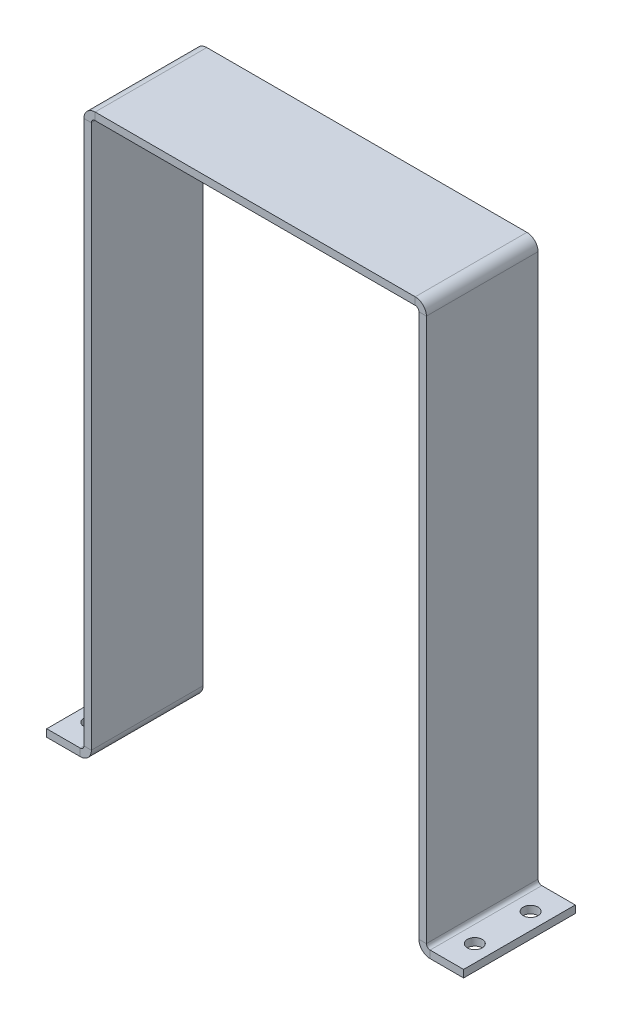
ISO-10303-21;
HEADER;
FILE_DESCRIPTION(('STEP AP214'),'2;1');
FILE_NAME('part.step','',(''),(''),'','','');
FILE_SCHEMA(('AUTOMOTIVE_DESIGN { 1 0 10303 214 1 1 1 1 }'));
ENDSEC;
DATA;
#1=APPLICATION_CONTEXT('core data for automotive mechanical design processes');
#2=APPLICATION_PROTOCOL_DEFINITION('international standard','automotive_design',2000,#1);
#3=PRODUCT_CONTEXT('',#1,'mechanical');
#4=PRODUCT('Part','Part','',(#3));
#5=PRODUCT_RELATED_PRODUCT_CATEGORY('part','',(#4));
#6=PRODUCT_DEFINITION_FORMATION('','',#4);
#7=PRODUCT_DEFINITION_CONTEXT('part definition',#1,'design');
#8=PRODUCT_DEFINITION('design','',#6,#7);
#9=PRODUCT_DEFINITION_SHAPE('','',#8);
#10=(LENGTH_UNIT() NAMED_UNIT(*) SI_UNIT(.MILLI.,.METRE.));
#11=(NAMED_UNIT(*) PLANE_ANGLE_UNIT() SI_UNIT($,.RADIAN.));
#12=(NAMED_UNIT(*) SI_UNIT($,.STERADIAN.) SOLID_ANGLE_UNIT());
#13=UNCERTAINTY_MEASURE_WITH_UNIT(LENGTH_MEASURE(1.E-05),#10,'distance_accuracy_value','');
#14=(GEOMETRIC_REPRESENTATION_CONTEXT(3) GLOBAL_UNCERTAINTY_ASSIGNED_CONTEXT((#13)) GLOBAL_UNIT_ASSIGNED_CONTEXT((#10,
#11,#12)) REPRESENTATION_CONTEXT('',''));
#15=CARTESIAN_POINT('',(0.,0.,0.));
#16=DIRECTION('',(0.,0.,1.));
#17=DIRECTION('',(1.,0.,0.));
#18=AXIS2_PLACEMENT_3D('',#15,#16,#17);
#19=CARTESIAN_POINT('',(-44.,75.5,30.));
#20=DIRECTION('',(0.,0.,1.));
#21=DIRECTION('',(0.,-1.,0.));
#22=AXIS2_PLACEMENT_3D('',#19,#20,#21);
#23=PLANE('',#22);
#24=DIRECTION('',(0.,1.,0.));
#25=VECTOR('',#24,1.);
#26=CARTESIAN_POINT('',(-46.,75.5,30.));
#27=LINE('',#26,#25);
#28=CARTESIAN_POINT('',(-46.,74.5,30.));
#29=VERTEX_POINT('',#28);
#30=CARTESIAN_POINT('',(-46.,-71.5,30.));
#31=VERTEX_POINT('',#30);
#32=EDGE_CURVE('E335',#29,#31,#27,.F.);
#33=ORIENTED_EDGE('',*,*,#32,.T.);
#34=DIRECTION('',(1.,0.,0.));
#35=VECTOR('',#34,1.);
#36=CARTESIAN_POINT('',(-46.,-71.5,30.));
#37=LINE('',#36,#35);
#38=CARTESIAN_POINT('',(-44.,-71.5,30.));
#39=VERTEX_POINT('',#38);
#40=EDGE_CURVE('E259',#31,#39,#37,.T.);
#41=ORIENTED_EDGE('',*,*,#40,.T.);
#42=DIRECTION('',(0.,-1.,0.));
#43=VECTOR('',#42,1.);
#44=CARTESIAN_POINT('',(-44.,75.5,30.));
#45=LINE('',#44,#43);
#46=CARTESIAN_POINT('',(-44.,74.5,30.));
#47=VERTEX_POINT('',#46);
#48=EDGE_CURVE('E380',#47,#39,#45,.T.);
#49=ORIENTED_EDGE('',*,*,#48,.F.);
#50=DIRECTION('',(-1.,0.,0.));
#51=VECTOR('',#50,1.);
#52=CARTESIAN_POINT('',(-44.,74.5,30.));
#53=LINE('',#52,#51);
#54=EDGE_CURVE('E78',#47,#29,#53,.T.);
#55=ORIENTED_EDGE('',*,*,#54,.T.);
#56=EDGE_LOOP('',(#33,#41,#49,#55));
#57=FACE_BOUND('',#56,.T.);
#58=ADVANCED_FACE('F74',(#57),#23,.T.);
#59=CARTESIAN_POINT('',(-46.,75.5,30.));
#60=DIRECTION('',(1.,0.,0.));
#61=DIRECTION('',(0.,1.,0.));
#62=AXIS2_PLACEMENT_3D('',#59,#60,#61);
#63=PLANE('',#62);
#64=DIRECTION('',(0.,0.,1.));
#65=VECTOR('',#64,1.);
#66=CARTESIAN_POINT('',(-46.,-71.5,30.));
#67=LINE('',#66,#65);
#68=CARTESIAN_POINT('',(-46.,-71.5,0.));
#69=VERTEX_POINT('',#68);
#70=EDGE_CURVE('E265',#31,#69,#67,.F.);
#71=ORIENTED_EDGE('',*,*,#70,.F.);
#72=ORIENTED_EDGE('',*,*,#32,.F.);
#73=DIRECTION('',(0.,0.,1.));
#74=VECTOR('',#73,1.);
#75=CARTESIAN_POINT('',(-46.,74.5,30.));
#76=LINE('',#75,#74);
#77=CARTESIAN_POINT('',(-46.,74.5,0.));
#78=VERTEX_POINT('',#77);
#79=EDGE_CURVE('E325',#29,#78,#76,.F.);
#80=ORIENTED_EDGE('',*,*,#79,.T.);
#81=DIRECTION('',(0.,1.,0.));
#82=VECTOR('',#81,1.);
#83=CARTESIAN_POINT('',(-46.,75.5,0.));
#84=LINE('',#83,#82);
#85=EDGE_CURVE('E340',#78,#69,#84,.F.);
#86=ORIENTED_EDGE('',*,*,#85,.T.);
#87=EDGE_LOOP('',(#71,#72,#80,#86));
#88=FACE_BOUND('',#87,.T.);
#89=ADVANCED_FACE('F452',(#88),#63,.F.);
#90=CARTESIAN_POINT('',(-44.,75.5,30.));
#91=DIRECTION('',(1.,0.,0.));
#92=DIRECTION('',(0.,1.,0.));
#93=AXIS2_PLACEMENT_3D('',#90,#91,#92);
#94=PLANE('',#93);
#95=ORIENTED_EDGE('',*,*,#48,.T.);
#96=DIRECTION('',(0.,0.,1.));
#97=VECTOR('',#96,1.);
#98=CARTESIAN_POINT('',(-44.,-71.5,30.));
#99=LINE('',#98,#97);
#100=CARTESIAN_POINT('',(-44.,-71.5,0.));
#101=VERTEX_POINT('',#100);
#102=EDGE_CURVE('E254',#39,#101,#99,.F.);
#103=ORIENTED_EDGE('',*,*,#102,.T.);
#104=DIRECTION('',(0.,-1.,0.));
#105=VECTOR('',#104,1.);
#106=CARTESIAN_POINT('',(-44.,75.5,0.));
#107=LINE('',#106,#105);
#108=CARTESIAN_POINT('',(-44.,74.5,0.));
#109=VERTEX_POINT('',#108);
#110=EDGE_CURVE('E377',#109,#101,#107,.T.);
#111=ORIENTED_EDGE('',*,*,#110,.F.);
#112=DIRECTION('',(0.,0.,-1.));
#113=VECTOR('',#112,1.);
#114=CARTESIAN_POINT('',(-44.,74.5,30.));
#115=LINE('',#114,#113);
#116=EDGE_CURVE('E389',#47,#109,#115,.T.);
#117=ORIENTED_EDGE('',*,*,#116,.F.);
#118=EDGE_LOOP('',(#95,#103,#111,#117));
#119=FACE_BOUND('',#118,.T.);
#120=ADVANCED_FACE('F456',(#119),#94,.T.);
#121=CARTESIAN_POINT('',(44.,75.5,0.));
#122=DIRECTION('',(0.,0.,1.));
#123=DIRECTION('',(0.,1.,0.));
#124=AXIS2_PLACEMENT_3D('',#121,#122,#123);
#125=PLANE('',#124);
#126=DIRECTION('',(0.,-1.,0.));
#127=VECTOR('',#126,1.);
#128=CARTESIAN_POINT('',(46.,75.5,0.));
#129=LINE('',#128,#127);
#130=CARTESIAN_POINT('',(46.,-71.5,0.));
#131=VERTEX_POINT('',#130);
#132=CARTESIAN_POINT('',(46.,74.5,0.));
#133=VERTEX_POINT('',#132);
#134=EDGE_CURVE('E357',#131,#133,#129,.F.);
#135=ORIENTED_EDGE('',*,*,#134,.F.);
#136=DIRECTION('',(-1.,0.,0.));
#137=VECTOR('',#136,1.);
#138=CARTESIAN_POINT('',(46.,-71.5,0.));
#139=LINE('',#138,#137);
#140=CARTESIAN_POINT('',(44.,-71.5,0.));
#141=VERTEX_POINT('',#140);
#142=EDGE_CURVE('E310',#131,#141,#139,.T.);
#143=ORIENTED_EDGE('',*,*,#142,.T.);
#144=DIRECTION('',(0.,1.,0.));
#145=VECTOR('',#144,1.);
#146=CARTESIAN_POINT('',(44.,75.5,0.));
#147=LINE('',#146,#145);
#148=CARTESIAN_POINT('',(44.,74.5,0.));
#149=VERTEX_POINT('',#148);
#150=EDGE_CURVE('E373',#141,#149,#147,.T.);
#151=ORIENTED_EDGE('',*,*,#150,.T.);
#152=DIRECTION('',(1.,0.,0.));
#153=VECTOR('',#152,1.);
#154=CARTESIAN_POINT('',(44.,74.5,0.));
#155=LINE('',#154,#153);
#156=EDGE_CURVE('E410',#149,#133,#155,.T.);
#157=ORIENTED_EDGE('',*,*,#156,.T.);
#158=EDGE_LOOP('',(#135,#143,#151,#157));
#159=FACE_BOUND('',#158,.T.);
#160=ADVANCED_FACE('F483',(#159),#125,.F.);
#161=CARTESIAN_POINT('',(46.,75.5,30.));
#162=DIRECTION('',(-1.,0.,0.));
#163=DIRECTION('',(0.,-1.,0.));
#164=AXIS2_PLACEMENT_3D('',#161,#162,#163);
#165=PLANE('',#164);
#166=DIRECTION('',(0.,0.,-1.));
#167=VECTOR('',#166,1.);
#168=CARTESIAN_POINT('',(46.,-71.5,0.));
#169=LINE('',#168,#167);
#170=CARTESIAN_POINT('',(46.,-71.5,30.));
#171=VERTEX_POINT('',#170);
#172=EDGE_CURVE('E316',#131,#171,#169,.F.);
#173=ORIENTED_EDGE('',*,*,#172,.F.);
#174=ORIENTED_EDGE('',*,*,#134,.T.);
#175=DIRECTION('',(0.,0.,1.));
#176=VECTOR('',#175,1.);
#177=CARTESIAN_POINT('',(46.,74.5,30.));
#178=LINE('',#177,#176);
#179=CARTESIAN_POINT('',(46.,74.5,30.));
#180=VERTEX_POINT('',#179);
#181=EDGE_CURVE('E329',#133,#180,#178,.T.);
#182=ORIENTED_EDGE('',*,*,#181,.T.);
#183=DIRECTION('',(0.,-1.,0.));
#184=VECTOR('',#183,1.);
#185=CARTESIAN_POINT('',(46.,75.5,30.));
#186=LINE('',#185,#184);
#187=EDGE_CURVE('E343',#171,#180,#186,.F.);
#188=ORIENTED_EDGE('',*,*,#187,.F.);
#189=EDGE_LOOP('',(#173,#174,#182,#188));
#190=FACE_BOUND('',#189,.T.);
#191=ADVANCED_FACE('F480',(#190),#165,.F.);
#192=CARTESIAN_POINT('',(44.,75.5,30.));
#193=DIRECTION('',(-1.,0.,0.));
#194=DIRECTION('',(0.,-1.,0.));
#195=AXIS2_PLACEMENT_3D('',#192,#193,#194);
#196=PLANE('',#195);
#197=ORIENTED_EDGE('',*,*,#150,.F.);
#198=DIRECTION('',(0.,0.,-1.));
#199=VECTOR('',#198,1.);
#200=CARTESIAN_POINT('',(44.,-71.5,0.));
#201=LINE('',#200,#199);
#202=CARTESIAN_POINT('',(44.,-71.5,30.));
#203=VERTEX_POINT('',#202);
#204=EDGE_CURVE('E305',#141,#203,#201,.F.);
#205=ORIENTED_EDGE('',*,*,#204,.T.);
#206=DIRECTION('',(0.,1.,0.));
#207=VECTOR('',#206,1.);
#208=CARTESIAN_POINT('',(44.,75.5,30.));
#209=LINE('',#208,#207);
#210=CARTESIAN_POINT('',(44.,74.5,30.));
#211=VERTEX_POINT('',#210);
#212=EDGE_CURVE('E375',#203,#211,#209,.T.);
#213=ORIENTED_EDGE('',*,*,#212,.T.);
#214=DIRECTION('',(0.,0.,-1.));
#215=VECTOR('',#214,1.);
#216=CARTESIAN_POINT('',(44.,74.5,30.));
#217=LINE('',#216,#215);
#218=EDGE_CURVE('E386',#149,#211,#217,.F.);
#219=ORIENTED_EDGE('',*,*,#218,.F.);
#220=EDGE_LOOP('',(#197,#205,#213,#219));
#221=FACE_BOUND('',#220,.T.);
#222=ADVANCED_FACE('F472',(#221),#196,.T.);
#223=CARTESIAN_POINT('',(-44.,75.5,30.));
#224=DIRECTION('',(0.,0.,1.));
#225=DIRECTION('',(-1.,0.,0.));
#226=AXIS2_PLACEMENT_3D('',#223,#224,#225);
#227=PLANE('',#226);
#228=DIRECTION('',(0.,1.,0.));
#229=VECTOR('',#228,1.);
#230=CARTESIAN_POINT('',(-43.,75.5,30.));
#231=LINE('',#230,#229);
#232=CARTESIAN_POINT('',(-43.,75.5,30.));
#233=VERTEX_POINT('',#232);
#234=CARTESIAN_POINT('',(-43.,77.5,30.));
#235=VERTEX_POINT('',#234);
#236=EDGE_CURVE('E13',#233,#235,#231,.T.);
#237=ORIENTED_EDGE('',*,*,#236,.F.);
#238=DIRECTION('',(-1.,0.,0.));
#239=VECTOR('',#238,1.);
#240=CARTESIAN_POINT('',(-44.,75.5,30.));
#241=LINE('',#240,#239);
#242=CARTESIAN_POINT('',(43.,75.5,30.));
#243=VERTEX_POINT('',#242);
#244=EDGE_CURVE('E369',#243,#233,#241,.T.);
#245=ORIENTED_EDGE('',*,*,#244,.F.);
#246=DIRECTION('',(0.,1.,0.));
#247=VECTOR('',#246,1.);
#248=CARTESIAN_POINT('',(43.,75.5,30.));
#249=LINE('',#248,#247);
#250=CARTESIAN_POINT('',(43.,77.5,30.));
#251=VERTEX_POINT('',#250);
#252=EDGE_CURVE('E83',#243,#251,#249,.T.);
#253=ORIENTED_EDGE('',*,*,#252,.T.);
#254=DIRECTION('',(1.,0.,0.));
#255=VECTOR('',#254,1.);
#256=CARTESIAN_POINT('',(-44.,77.5,30.));
#257=LINE('',#256,#255);
#258=EDGE_CURVE('E352',#251,#235,#257,.F.);
#259=ORIENTED_EDGE('',*,*,#258,.T.);
#260=EDGE_LOOP('',(#237,#245,#253,#259));
#261=FACE_BOUND('',#260,.T.);
#262=ADVANCED_FACE('F419',(#261),#227,.T.);
#263=CARTESIAN_POINT('',(43.,74.5,30.));
#264=DIRECTION('',(0.,0.,-1.));
#265=DIRECTION('',(-1.,0.,0.));
#266=AXIS2_PLACEMENT_3D('',#263,#264,#265);
#267=PLANE('',#266);
#268=ORIENTED_EDGE('',*,*,#252,.F.);
#269=CARTESIAN_POINT('',(43.,74.5,30.));
#270=DIRECTION('',(0.,0.,1.));
#271=DIRECTION('',(1.,0.,0.));
#272=AXIS2_PLACEMENT_3D('',#269,#270,#271);
#273=CIRCLE('',#272,1.);
#274=EDGE_CURVE('E370',#243,#211,#273,.F.);
#275=ORIENTED_EDGE('',*,*,#274,.T.);
#276=DIRECTION('',(1.,0.,0.));
#277=VECTOR('',#276,1.);
#278=CARTESIAN_POINT('',(44.,74.5,30.));
#279=LINE('',#278,#277);
#280=EDGE_CURVE('E413',#211,#180,#279,.T.);
#281=ORIENTED_EDGE('',*,*,#280,.T.);
#282=CARTESIAN_POINT('',(43.,74.5,30.));
#283=DIRECTION('',(0.,0.,-1.));
#284=DIRECTION('',(-1.,0.,0.));
#285=AXIS2_PLACEMENT_3D('',#282,#283,#284);
#286=CIRCLE('',#285,3.);
#287=EDGE_CURVE('E353',#251,#180,#286,.T.);
#288=ORIENTED_EDGE('',*,*,#287,.F.);
#289=EDGE_LOOP('',(#268,#275,#281,#288));
#290=FACE_BOUND('',#289,.T.);
#291=ADVANCED_FACE('F427',(#290),#267,.F.);
#292=CARTESIAN_POINT('',(44.,75.5,30.));
#293=DIRECTION('',(0.,0.,1.));
#294=DIRECTION('',(0.,1.,0.));
#295=AXIS2_PLACEMENT_3D('',#292,#293,#294);
#296=PLANE('',#295);
#297=DIRECTION('',(-1.,0.,0.));
#298=VECTOR('',#297,1.);
#299=CARTESIAN_POINT('',(46.,-71.5,30.));
#300=LINE('',#299,#298);
#301=EDGE_CURVE('E320',#171,#203,#300,.T.);
#302=ORIENTED_EDGE('',*,*,#301,.F.);
#303=ORIENTED_EDGE('',*,*,#187,.T.);
#304=ORIENTED_EDGE('',*,*,#280,.F.);
#305=ORIENTED_EDGE('',*,*,#212,.F.);
#306=EDGE_LOOP('',(#302,#303,#304,#305));
#307=FACE_BOUND('',#306,.T.);
#308=ADVANCED_FACE('F476',(#307),#296,.T.);
#309=CARTESIAN_POINT('',(43.,74.5,0.));
#310=DIRECTION('',(0.,0.,1.));
#311=DIRECTION('',(1.,0.,0.));
#312=AXIS2_PLACEMENT_3D('',#309,#310,#311);
#313=PLANE('',#312);
#314=ORIENTED_EDGE('',*,*,#156,.F.);
#315=CARTESIAN_POINT('',(43.,74.5,0.));
#316=DIRECTION('',(0.,0.,-1.));
#317=DIRECTION('',(-1.,0.,0.));
#318=AXIS2_PLACEMENT_3D('',#315,#316,#317);
#319=CIRCLE('',#318,1.);
#320=CARTESIAN_POINT('',(43.,75.5,0.));
#321=VERTEX_POINT('',#320);
#322=EDGE_CURVE('E390',#149,#321,#319,.F.);
#323=ORIENTED_EDGE('',*,*,#322,.T.);
#324=DIRECTION('',(0.,1.,0.));
#325=VECTOR('',#324,1.);
#326=CARTESIAN_POINT('',(43.,75.5,0.));
#327=LINE('',#326,#325);
#328=CARTESIAN_POINT('',(43.,77.5,0.));
#329=VERTEX_POINT('',#328);
#330=EDGE_CURVE('E408',#321,#329,#327,.T.);
#331=ORIENTED_EDGE('',*,*,#330,.T.);
#332=CARTESIAN_POINT('',(43.,74.5,0.));
#333=DIRECTION('',(0.,0.,-1.));
#334=DIRECTION('',(-1.,0.,0.));
#335=AXIS2_PLACEMENT_3D('',#332,#333,#334);
#336=CIRCLE('',#335,3.);
#337=EDGE_CURVE('E354',#133,#329,#336,.F.);
#338=ORIENTED_EDGE('',*,*,#337,.F.);
#339=EDGE_LOOP('',(#314,#323,#331,#338));
#340=FACE_BOUND('',#339,.T.);
#341=ADVANCED_FACE('F484',(#340),#313,.F.);
#342=CARTESIAN_POINT('',(-44.,75.5,0.));
#343=DIRECTION('',(0.,0.,1.));
#344=DIRECTION('',(-1.,0.,0.));
#345=AXIS2_PLACEMENT_3D('',#342,#343,#344);
#346=PLANE('',#345);
#347=ORIENTED_EDGE('',*,*,#330,.F.);
#348=DIRECTION('',(-1.,0.,0.));
#349=VECTOR('',#348,1.);
#350=CARTESIAN_POINT('',(-44.,75.5,0.));
#351=LINE('',#350,#349);
#352=CARTESIAN_POINT('',(-43.,75.5,0.));
#353=VERTEX_POINT('',#352);
#354=EDGE_CURVE('E366',#321,#353,#351,.T.);
#355=ORIENTED_EDGE('',*,*,#354,.T.);
#356=DIRECTION('',(0.,1.,0.));
#357=VECTOR('',#356,1.);
#358=CARTESIAN_POINT('',(-43.,75.5,0.));
#359=LINE('',#358,#357);
#360=CARTESIAN_POINT('',(-43.,77.5,0.));
#361=VERTEX_POINT('',#360);
#362=EDGE_CURVE('E406',#353,#361,#359,.T.);
#363=ORIENTED_EDGE('',*,*,#362,.T.);
#364=DIRECTION('',(1.,0.,0.));
#365=VECTOR('',#364,1.);
#366=CARTESIAN_POINT('',(-44.,77.5,0.));
#367=LINE('',#366,#365);
#368=EDGE_CURVE('E349',#329,#361,#367,.F.);
#369=ORIENTED_EDGE('',*,*,#368,.F.);
#370=EDGE_LOOP('',(#347,#355,#363,#369));
#371=FACE_BOUND('',#370,.T.);
#372=ADVANCED_FACE('F437',(#371),#346,.F.);
#373=CARTESIAN_POINT('',(-43.,74.5,0.));
#374=DIRECTION('',(0.,0.,1.));
#375=DIRECTION('',(1.,0.,0.));
#376=AXIS2_PLACEMENT_3D('',#373,#374,#375);
#377=PLANE('',#376);
#378=ORIENTED_EDGE('',*,*,#362,.F.);
#379=CARTESIAN_POINT('',(-43.,74.5,0.));
#380=DIRECTION('',(0.,0.,-1.));
#381=DIRECTION('',(-1.,0.,0.));
#382=AXIS2_PLACEMENT_3D('',#379,#380,#381);
#383=CIRCLE('',#382,1.);
#384=EDGE_CURVE('E322',#353,#109,#383,.F.);
#385=ORIENTED_EDGE('',*,*,#384,.T.);
#386=DIRECTION('',(-1.,0.,0.));
#387=VECTOR('',#386,1.);
#388=CARTESIAN_POINT('',(-44.,74.5,0.));
#389=LINE('',#388,#387);
#390=EDGE_CURVE('E404',#109,#78,#389,.T.);
#391=ORIENTED_EDGE('',*,*,#390,.T.);
#392=CARTESIAN_POINT('',(-43.,74.5,0.));
#393=DIRECTION('',(0.,0.,-1.));
#394=DIRECTION('',(-1.,0.,0.));
#395=AXIS2_PLACEMENT_3D('',#392,#393,#394);
#396=CIRCLE('',#395,3.);
#397=EDGE_CURVE('E344',#361,#78,#396,.F.);
#398=ORIENTED_EDGE('',*,*,#397,.F.);
#399=EDGE_LOOP('',(#378,#385,#391,#398));
#400=FACE_BOUND('',#399,.T.);
#401=ADVANCED_FACE('F440',(#400),#377,.F.);
#402=CARTESIAN_POINT('',(-44.,75.5,0.));
#403=DIRECTION('',(0.,0.,1.));
#404=DIRECTION('',(0.,-1.,0.));
#405=AXIS2_PLACEMENT_3D('',#402,#403,#404);
#406=PLANE('',#405);
#407=DIRECTION('',(1.,0.,0.));
#408=VECTOR('',#407,1.);
#409=CARTESIAN_POINT('',(-46.,-71.5,0.));
#410=LINE('',#409,#408);
#411=EDGE_CURVE('E270',#69,#101,#410,.T.);
#412=ORIENTED_EDGE('',*,*,#411,.F.);
#413=ORIENTED_EDGE('',*,*,#85,.F.);
#414=ORIENTED_EDGE('',*,*,#390,.F.);
#415=ORIENTED_EDGE('',*,*,#110,.T.);
#416=EDGE_LOOP('',(#412,#413,#414,#415));
#417=FACE_BOUND('',#416,.T.);
#418=ADVANCED_FACE('F503',(#417),#406,.F.);
#419=CARTESIAN_POINT('',(-43.,74.5,30.));
#420=DIRECTION('',(0.,0.,-1.));
#421=DIRECTION('',(-1.,0.,0.));
#422=AXIS2_PLACEMENT_3D('',#419,#420,#421);
#423=PLANE('',#422);
#424=CARTESIAN_POINT('',(-43.,74.5,30.));
#425=DIRECTION('',(0.,0.,1.));
#426=DIRECTION('',(1.,0.,0.));
#427=AXIS2_PLACEMENT_3D('',#424,#425,#426);
#428=CIRCLE('',#427,1.);
#429=EDGE_CURVE('E393',#47,#233,#428,.F.);
#430=ORIENTED_EDGE('',*,*,#429,.T.);
#431=ORIENTED_EDGE('',*,*,#236,.T.);
#432=CARTESIAN_POINT('',(-43.,74.5,30.));
#433=DIRECTION('',(0.,0.,-1.));
#434=DIRECTION('',(-1.,0.,0.));
#435=AXIS2_PLACEMENT_3D('',#432,#433,#434);
#436=CIRCLE('',#435,3.);
#437=EDGE_CURVE('E347',#29,#235,#436,.T.);
#438=ORIENTED_EDGE('',*,*,#437,.F.);
#439=ORIENTED_EDGE('',*,*,#54,.F.);
#440=EDGE_LOOP('',(#430,#431,#438,#439));
#441=FACE_BOUND('',#440,.T.);
#442=ADVANCED_FACE('F76',(#441),#423,.F.);
#443=CARTESIAN_POINT('',(-44.,77.5,30.));
#444=DIRECTION('',(0.,-1.,0.));
#445=DIRECTION('',(0.,0.,-1.));
#446=AXIS2_PLACEMENT_3D('',#443,#444,#445);
#447=PLANE('',#446);
#448=ORIENTED_EDGE('',*,*,#368,.T.);
#449=DIRECTION('',(0.,0.,-1.));
#450=VECTOR('',#449,1.);
#451=CARTESIAN_POINT('',(-43.,77.5,30.));
#452=LINE('',#451,#450);
#453=EDGE_CURVE('E328',#361,#235,#452,.F.);
#454=ORIENTED_EDGE('',*,*,#453,.T.);
#455=ORIENTED_EDGE('',*,*,#258,.F.);
#456=DIRECTION('',(0.,0.,-1.));
#457=VECTOR('',#456,1.);
#458=CARTESIAN_POINT('',(43.,77.5,30.));
#459=LINE('',#458,#457);
#460=EDGE_CURVE('E332',#251,#329,#459,.T.);
#461=ORIENTED_EDGE('',*,*,#460,.T.);
#462=EDGE_LOOP('',(#448,#454,#455,#461));
#463=FACE_BOUND('',#462,.T.);
#464=ADVANCED_FACE('F424',(#463),#447,.F.);
#465=CARTESIAN_POINT('',(43.,74.5,30.));
#466=DIRECTION('',(0.,0.,-1.));
#467=DIRECTION('',(-1.,0.,0.));
#468=AXIS2_PLACEMENT_3D('',#465,#466,#467);
#469=CYLINDRICAL_SURFACE('',#468,3.);
#470=ORIENTED_EDGE('',*,*,#287,.T.);
#471=ORIENTED_EDGE('',*,*,#181,.F.);
#472=ORIENTED_EDGE('',*,*,#337,.T.);
#473=ORIENTED_EDGE('',*,*,#460,.F.);
#474=EDGE_LOOP('',(#470,#471,#472,#473));
#475=FACE_BOUND('',#474,.T.);
#476=ADVANCED_FACE('F431',(#475),#469,.T.);
#477=CARTESIAN_POINT('',(-43.,74.5,30.));
#478=DIRECTION('',(0.,0.,-1.));
#479=DIRECTION('',(-1.,0.,0.));
#480=AXIS2_PLACEMENT_3D('',#477,#478,#479);
#481=CYLINDRICAL_SURFACE('',#480,3.);
#482=ORIENTED_EDGE('',*,*,#437,.T.);
#483=ORIENTED_EDGE('',*,*,#453,.F.);
#484=ORIENTED_EDGE('',*,*,#397,.T.);
#485=ORIENTED_EDGE('',*,*,#79,.F.);
#486=EDGE_LOOP('',(#482,#483,#484,#485));
#487=FACE_BOUND('',#486,.T.);
#488=ADVANCED_FACE('F445',(#487),#481,.T.);
#489=CARTESIAN_POINT('',(-44.,75.5,30.));
#490=DIRECTION('',(0.,-1.,0.));
#491=DIRECTION('',(0.,0.,-1.));
#492=AXIS2_PLACEMENT_3D('',#489,#490,#491);
#493=PLANE('',#492);
#494=ORIENTED_EDGE('',*,*,#354,.F.);
#495=DIRECTION('',(0.,0.,-1.));
#496=VECTOR('',#495,1.);
#497=CARTESIAN_POINT('',(43.,75.5,30.));
#498=LINE('',#497,#496);
#499=EDGE_CURVE('E383',#243,#321,#498,.T.);
#500=ORIENTED_EDGE('',*,*,#499,.F.);
#501=ORIENTED_EDGE('',*,*,#244,.T.);
#502=DIRECTION('',(0.,0.,-1.));
#503=VECTOR('',#502,1.);
#504=CARTESIAN_POINT('',(-43.,75.5,30.));
#505=LINE('',#504,#503);
#506=EDGE_CURVE('E348',#353,#233,#505,.F.);
#507=ORIENTED_EDGE('',*,*,#506,.F.);
#508=EDGE_LOOP('',(#494,#500,#501,#507));
#509=FACE_BOUND('',#508,.T.);
#510=ADVANCED_FACE('F464',(#509),#493,.T.);
#511=CARTESIAN_POINT('',(43.,74.5,30.));
#512=DIRECTION('',(0.,0.,-1.));
#513=DIRECTION('',(-1.,0.,0.));
#514=AXIS2_PLACEMENT_3D('',#511,#512,#513);
#515=CYLINDRICAL_SURFACE('',#514,1.);
#516=ORIENTED_EDGE('',*,*,#274,.F.);
#517=ORIENTED_EDGE('',*,*,#499,.T.);
#518=ORIENTED_EDGE('',*,*,#322,.F.);
#519=ORIENTED_EDGE('',*,*,#218,.T.);
#520=EDGE_LOOP('',(#516,#517,#518,#519));
#521=FACE_BOUND('',#520,.T.);
#522=ADVANCED_FACE('F468',(#521),#515,.F.);
#523=CARTESIAN_POINT('',(-43.,74.5,30.));
#524=DIRECTION('',(0.,0.,-1.));
#525=DIRECTION('',(-1.,0.,0.));
#526=AXIS2_PLACEMENT_3D('',#523,#524,#525);
#527=CYLINDRICAL_SURFACE('',#526,1.);
#528=ORIENTED_EDGE('',*,*,#429,.F.);
#529=ORIENTED_EDGE('',*,*,#116,.T.);
#530=ORIENTED_EDGE('',*,*,#384,.F.);
#531=ORIENTED_EDGE('',*,*,#506,.T.);
#532=EDGE_LOOP('',(#528,#529,#530,#531));
#533=FACE_BOUND('',#532,.T.);
#534=ADVANCED_FACE('F461',(#533),#527,.F.);
#535=CARTESIAN_POINT('',(47.,-71.5,30.));
#536=DIRECTION('',(0.,0.,1.));
#537=DIRECTION('',(1.,0.,0.));
#538=AXIS2_PLACEMENT_3D('',#535,#536,#537);
#539=PLANE('',#538);
#540=DIRECTION('',(0.,1.,0.));
#541=VECTOR('',#540,1.);
#542=CARTESIAN_POINT('',(47.,-74.5,30.));
#543=LINE('',#542,#541);
#544=CARTESIAN_POINT('',(47.,-72.5,30.));
#545=VERTEX_POINT('',#544);
#546=CARTESIAN_POINT('',(47.,-74.5,30.));
#547=VERTEX_POINT('',#546);
#548=EDGE_CURVE('E272',#545,#547,#543,.F.);
#549=ORIENTED_EDGE('',*,*,#548,.F.);
#550=CARTESIAN_POINT('',(47.,-71.5,30.));
#551=DIRECTION('',(0.,0.,-1.));
#552=DIRECTION('',(-1.,0.,0.));
#553=AXIS2_PLACEMENT_3D('',#550,#551,#552);
#554=CIRCLE('',#553,1.);
#555=EDGE_CURVE('E313',#171,#545,#554,.F.);
#556=ORIENTED_EDGE('',*,*,#555,.F.);
#557=ORIENTED_EDGE('',*,*,#301,.T.);
#558=CARTESIAN_POINT('',(47.,-71.5,30.));
#559=DIRECTION('',(0.,0.,-1.));
#560=DIRECTION('',(-1.,0.,0.));
#561=AXIS2_PLACEMENT_3D('',#558,#559,#560);
#562=CIRCLE('',#561,3.);
#563=EDGE_CURVE('E98',#203,#547,#562,.F.);
#564=ORIENTED_EDGE('',*,*,#563,.T.);
#565=EDGE_LOOP('',(#549,#556,#557,#564));
#566=FACE_BOUND('',#565,.T.);
#567=ADVANCED_FACE('F558',(#566),#539,.T.);
#568=CARTESIAN_POINT('',(47.,-71.5,0.));
#569=DIRECTION('',(0.,0.,1.));
#570=DIRECTION('',(1.,0.,0.));
#571=AXIS2_PLACEMENT_3D('',#568,#569,#570);
#572=PLANE('',#571);
#573=CARTESIAN_POINT('',(47.,-71.5,0.));
#574=DIRECTION('',(0.,0.,-1.));
#575=DIRECTION('',(-1.,0.,0.));
#576=AXIS2_PLACEMENT_3D('',#573,#574,#575);
#577=CIRCLE('',#576,1.);
#578=CARTESIAN_POINT('',(47.,-72.5,0.));
#579=VERTEX_POINT('',#578);
#580=EDGE_CURVE('E278',#579,#131,#577,.T.);
#581=ORIENTED_EDGE('',*,*,#580,.F.);
#582=DIRECTION('',(0.,1.,0.));
#583=VECTOR('',#582,1.);
#584=CARTESIAN_POINT('',(47.,-72.5,0.));
#585=LINE('',#584,#583);
#586=CARTESIAN_POINT('',(47.,-74.5,0.));
#587=VERTEX_POINT('',#586);
#588=EDGE_CURVE('E298',#579,#587,#585,.F.);
#589=ORIENTED_EDGE('',*,*,#588,.T.);
#590=CARTESIAN_POINT('',(47.,-71.5,0.));
#591=DIRECTION('',(0.,0.,-1.));
#592=DIRECTION('',(-1.,0.,0.));
#593=AXIS2_PLACEMENT_3D('',#590,#591,#592);
#594=CIRCLE('',#593,3.);
#595=EDGE_CURVE('E308',#587,#141,#594,.T.);
#596=ORIENTED_EDGE('',*,*,#595,.T.);
#597=ORIENTED_EDGE('',*,*,#142,.F.);
#598=EDGE_LOOP('',(#581,#589,#596,#597));
#599=FACE_BOUND('',#598,.T.);
#600=ADVANCED_FACE('F563',(#599),#572,.F.);
#601=CARTESIAN_POINT('',(47.,-71.5,0.));
#602=DIRECTION('',(0.,0.,-1.));
#603=DIRECTION('',(0.,-1.,0.));
#604=AXIS2_PLACEMENT_3D('',#601,#602,#603);
#605=CYLINDRICAL_SURFACE('',#604,3.);
#606=ORIENTED_EDGE('',*,*,#204,.F.);
#607=ORIENTED_EDGE('',*,*,#595,.F.);
#608=DIRECTION('',(0.,0.,-1.));
#609=VECTOR('',#608,1.);
#610=CARTESIAN_POINT('',(47.,-74.5,30.));
#611=LINE('',#610,#609);
#612=EDGE_CURVE('E296',#587,#547,#611,.F.);
#613=ORIENTED_EDGE('',*,*,#612,.T.);
#614=ORIENTED_EDGE('',*,*,#563,.F.);
#615=EDGE_LOOP('',(#606,#607,#613,#614));
#616=FACE_BOUND('',#615,.T.);
#617=ADVANCED_FACE('F571',(#616),#605,.T.);
#618=CARTESIAN_POINT('',(47.,-71.5,0.));
#619=DIRECTION('',(0.,0.,-1.));
#620=DIRECTION('',(0.,-1.,0.));
#621=AXIS2_PLACEMENT_3D('',#618,#619,#620);
#622=CYLINDRICAL_SURFACE('',#621,1.);
#623=ORIENTED_EDGE('',*,*,#172,.T.);
#624=ORIENTED_EDGE('',*,*,#555,.T.);
#625=DIRECTION('',(0.,0.,-1.));
#626=VECTOR('',#625,1.);
#627=CARTESIAN_POINT('',(47.,-72.5,30.));
#628=LINE('',#627,#626);
#629=EDGE_CURVE('E301',#545,#579,#628,.T.);
#630=ORIENTED_EDGE('',*,*,#629,.T.);
#631=ORIENTED_EDGE('',*,*,#580,.T.);
#632=EDGE_LOOP('',(#623,#624,#630,#631));
#633=FACE_BOUND('',#632,.T.);
#634=ADVANCED_FACE('F579',(#633),#622,.F.);
#635=CARTESIAN_POINT('',(56.,-74.5,0.));
#636=DIRECTION('',(0.,0.,1.));
#637=DIRECTION('',(1.,0.,0.));
#638=AXIS2_PLACEMENT_3D('',#635,#636,#637);
#639=PLANE('',#638);
#640=ORIENTED_EDGE('',*,*,#588,.F.);
#641=DIRECTION('',(-1.,0.,0.));
#642=VECTOR('',#641,1.);
#643=CARTESIAN_POINT('',(56.,-72.5,0.));
#644=LINE('',#643,#642);
#645=CARTESIAN_POINT('',(56.,-72.5,0.));
#646=VERTEX_POINT('',#645);
#647=EDGE_CURVE('E294',#579,#646,#644,.F.);
#648=ORIENTED_EDGE('',*,*,#647,.T.);
#649=DIRECTION('',(0.,1.,0.));
#650=VECTOR('',#649,1.);
#651=CARTESIAN_POINT('',(56.,-74.5,0.));
#652=LINE('',#651,#650);
#653=CARTESIAN_POINT('',(56.,-74.5,0.));
#654=VERTEX_POINT('',#653);
#655=EDGE_CURVE('E275',#654,#646,#652,.T.);
#656=ORIENTED_EDGE('',*,*,#655,.F.);
#657=DIRECTION('',(1.,0.,0.));
#658=VECTOR('',#657,1.);
#659=CARTESIAN_POINT('',(-2.13762001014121E-13,-74.4999999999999,0.));
#660=LINE('',#659,#658);
#661=EDGE_CURVE('E287',#587,#654,#660,.T.);
#662=ORIENTED_EDGE('',*,*,#661,.F.);
#663=EDGE_LOOP('',(#640,#648,#656,#662));
#664=FACE_BOUND('',#663,.T.);
#665=ADVANCED_FACE('F586',(#664),#639,.F.);
#666=CARTESIAN_POINT('',(46.,-74.5,30.));
#667=DIRECTION('',(0.,0.,-1.));
#668=DIRECTION('',(-1.,0.,0.));
#669=AXIS2_PLACEMENT_3D('',#666,#667,#668);
#670=PLANE('',#669);
#671=ORIENTED_EDGE('',*,*,#548,.T.);
#672=DIRECTION('',(-1.,0.,0.));
#673=VECTOR('',#672,1.);
#674=CARTESIAN_POINT('',(-2.13762001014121E-13,-74.4999999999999,30.));
#675=LINE('',#674,#673);
#676=CARTESIAN_POINT('',(56.,-74.5,30.));
#677=VERTEX_POINT('',#676);
#678=EDGE_CURVE('E282',#677,#547,#675,.T.);
#679=ORIENTED_EDGE('',*,*,#678,.F.);
#680=DIRECTION('',(0.,1.,0.));
#681=VECTOR('',#680,1.);
#682=CARTESIAN_POINT('',(56.,-74.5,30.));
#683=LINE('',#682,#681);
#684=CARTESIAN_POINT('',(56.,-72.5,30.));
#685=VERTEX_POINT('',#684);
#686=EDGE_CURVE('E279',#677,#685,#683,.T.);
#687=ORIENTED_EDGE('',*,*,#686,.T.);
#688=DIRECTION('',(1.,0.,0.));
#689=VECTOR('',#688,1.);
#690=CARTESIAN_POINT('',(46.,-72.5,30.));
#691=LINE('',#690,#689);
#692=EDGE_CURVE('E289',#685,#545,#691,.F.);
#693=ORIENTED_EDGE('',*,*,#692,.T.);
#694=EDGE_LOOP('',(#671,#679,#687,#693));
#695=FACE_BOUND('',#694,.T.);
#696=ADVANCED_FACE('F594',(#695),#670,.F.);
#697=CARTESIAN_POINT('',(-2.13762001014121E-13,-74.4999999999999,0.));
#698=DIRECTION('',(0.,1.,0.));
#699=DIRECTION('',(-1.,0.,0.));
#700=AXIS2_PLACEMENT_3D('',#697,#698,#699);
#701=PLANE('',#700);
#702=CARTESIAN_POINT('',(51.5,-74.5,22.5));
#703=DIRECTION('',(0.,1.,0.));
#704=DIRECTION('',(-1.,0.,0.));
#705=AXIS2_PLACEMENT_3D('',#702,#703,#704);
#706=CIRCLE('',#705,2.);
#707=CARTESIAN_POINT('',(49.5,-74.5,22.5));
#708=VERTEX_POINT('',#707);
#709=EDGE_CURVE('E979',#708,#708,#706,.T.);
#710=ORIENTED_EDGE('',*,*,#709,.T.);
#711=EDGE_LOOP('',(#710));
#712=FACE_BOUND('',#711,.T.);
#713=CARTESIAN_POINT('',(51.5,-74.5,7.5));
#714=DIRECTION('',(0.,1.,0.));
#715=DIRECTION('',(-1.,0.,0.));
#716=AXIS2_PLACEMENT_3D('',#713,#714,#715);
#717=CIRCLE('',#716,2.);
#718=CARTESIAN_POINT('',(49.5,-74.5,7.5));
#719=VERTEX_POINT('',#718);
#720=EDGE_CURVE('E253',#719,#719,#717,.T.);
#721=ORIENTED_EDGE('',*,*,#720,.T.);
#722=EDGE_LOOP('',(#721));
#723=FACE_BOUND('',#722,.T.);
#724=ORIENTED_EDGE('',*,*,#612,.F.);
#725=ORIENTED_EDGE('',*,*,#661,.T.);
#726=DIRECTION('',(0.,0.,1.));
#727=VECTOR('',#726,1.);
#728=CARTESIAN_POINT('',(56.,-74.5,0.));
#729=LINE('',#728,#727);
#730=EDGE_CURVE('E285',#654,#677,#729,.T.);
#731=ORIENTED_EDGE('',*,*,#730,.T.);
#732=ORIENTED_EDGE('',*,*,#678,.T.);
#733=EDGE_LOOP('',(#724,#725,#731,#732));
#734=FACE_BOUND('',#733,.T.);
#735=ADVANCED_FACE('F602',(#712,#723,#734),#701,.F.);
#736=CARTESIAN_POINT('',(-2.07056594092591E-13,-72.4999999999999,0.));
#737=DIRECTION('',(0.,1.,0.));
#738=DIRECTION('',(-1.,0.,0.));
#739=AXIS2_PLACEMENT_3D('',#736,#737,#738);
#740=PLANE('',#739);
#741=CARTESIAN_POINT('',(51.5,-72.5000000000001,22.5));
#742=DIRECTION('',(0.,1.,0.));
#743=DIRECTION('',(-1.,0.,0.));
#744=AXIS2_PLACEMENT_3D('',#741,#742,#743);
#745=CIRCLE('',#744,2.);
#746=CARTESIAN_POINT('',(49.5,-72.5000000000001,22.5));
#747=VERTEX_POINT('',#746);
#748=EDGE_CURVE('E976',#747,#747,#745,.T.);
#749=ORIENTED_EDGE('',*,*,#748,.F.);
#750=EDGE_LOOP('',(#749));
#751=FACE_BOUND('',#750,.T.);
#752=CARTESIAN_POINT('',(51.5,-72.5000000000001,7.5));
#753=DIRECTION('',(0.,1.,0.));
#754=DIRECTION('',(-1.,0.,0.));
#755=AXIS2_PLACEMENT_3D('',#752,#753,#754);
#756=CIRCLE('',#755,2.);
#757=CARTESIAN_POINT('',(49.5,-72.5000000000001,7.5));
#758=VERTEX_POINT('',#757);
#759=EDGE_CURVE('E982',#758,#758,#756,.T.);
#760=ORIENTED_EDGE('',*,*,#759,.F.);
#761=EDGE_LOOP('',(#760));
#762=FACE_BOUND('',#761,.T.);
#763=ORIENTED_EDGE('',*,*,#647,.F.);
#764=ORIENTED_EDGE('',*,*,#629,.F.);
#765=ORIENTED_EDGE('',*,*,#692,.F.);
#766=DIRECTION('',(0.,0.,-1.));
#767=VECTOR('',#766,1.);
#768=CARTESIAN_POINT('',(56.,-72.5,30.));
#769=LINE('',#768,#767);
#770=EDGE_CURVE('E292',#646,#685,#769,.F.);
#771=ORIENTED_EDGE('',*,*,#770,.F.);
#772=EDGE_LOOP('',(#763,#764,#765,#771));
#773=FACE_BOUND('',#772,.T.);
#774=ADVANCED_FACE('F611',(#751,#762,#773),#740,.T.);
#775=CARTESIAN_POINT('',(56.,-74.5,30.));
#776=DIRECTION('',(-1.,0.,0.));
#777=DIRECTION('',(0.,-1.,0.));
#778=AXIS2_PLACEMENT_3D('',#775,#776,#777);
#779=PLANE('',#778);
#780=ORIENTED_EDGE('',*,*,#770,.T.);
#781=ORIENTED_EDGE('',*,*,#686,.F.);
#782=ORIENTED_EDGE('',*,*,#730,.F.);
#783=ORIENTED_EDGE('',*,*,#655,.T.);
#784=EDGE_LOOP('',(#780,#781,#782,#783));
#785=FACE_BOUND('',#784,.T.);
#786=ADVANCED_FACE('F620',(#785),#779,.F.);
#787=CARTESIAN_POINT('',(-47.,-71.5,0.));
#788=DIRECTION('',(0.,0.,-1.));
#789=DIRECTION('',(-1.,0.,0.));
#790=AXIS2_PLACEMENT_3D('',#787,#788,#789);
#791=PLANE('',#790);
#792=DIRECTION('',(0.,1.,0.));
#793=VECTOR('',#792,1.);
#794=CARTESIAN_POINT('',(-47.,-74.5,0.));
#795=LINE('',#794,#793);
#796=CARTESIAN_POINT('',(-47.,-72.5,0.));
#797=VERTEX_POINT('',#796);
#798=CARTESIAN_POINT('',(-47.,-74.5,0.));
#799=VERTEX_POINT('',#798);
#800=EDGE_CURVE('E235',#797,#799,#795,.F.);
#801=ORIENTED_EDGE('',*,*,#800,.F.);
#802=CARTESIAN_POINT('',(-47.,-71.5,0.));
#803=DIRECTION('',(0.,0.,1.));
#804=DIRECTION('',(1.,0.,0.));
#805=AXIS2_PLACEMENT_3D('',#802,#803,#804);
#806=CIRCLE('',#805,1.);
#807=EDGE_CURVE('E262',#69,#797,#806,.F.);
#808=ORIENTED_EDGE('',*,*,#807,.F.);
#809=ORIENTED_EDGE('',*,*,#411,.T.);
#810=CARTESIAN_POINT('',(-47.,-71.5,0.));
#811=DIRECTION('',(0.,0.,1.));
#812=DIRECTION('',(1.,0.,0.));
#813=AXIS2_PLACEMENT_3D('',#810,#811,#812);
#814=CIRCLE('',#813,3.);
#815=EDGE_CURVE('E90',#101,#799,#814,.F.);
#816=ORIENTED_EDGE('',*,*,#815,.T.);
#817=EDGE_LOOP('',(#801,#808,#809,#816));
#818=FACE_BOUND('',#817,.T.);
#819=ADVANCED_FACE('F628',(#818),#791,.T.);
#820=CARTESIAN_POINT('',(-47.,-71.5,30.));
#821=DIRECTION('',(0.,0.,-1.));
#822=DIRECTION('',(-1.,0.,0.));
#823=AXIS2_PLACEMENT_3D('',#820,#821,#822);
#824=PLANE('',#823);
#825=CARTESIAN_POINT('',(-47.,-71.5,30.));
#826=DIRECTION('',(0.,0.,1.));
#827=DIRECTION('',(1.,0.,0.));
#828=AXIS2_PLACEMENT_3D('',#825,#826,#827);
#829=CIRCLE('',#828,1.);
#830=CARTESIAN_POINT('',(-47.,-72.5,30.));
#831=VERTEX_POINT('',#830);
#832=EDGE_CURVE('E267',#831,#31,#829,.T.);
#833=ORIENTED_EDGE('',*,*,#832,.F.);
#834=DIRECTION('',(0.,1.,0.));
#835=VECTOR('',#834,1.);
#836=CARTESIAN_POINT('',(-47.,-72.5,30.));
#837=LINE('',#836,#835);
#838=CARTESIAN_POINT('',(-47.,-74.5,30.));
#839=VERTEX_POINT('',#838);
#840=EDGE_CURVE('E247',#831,#839,#837,.F.);
#841=ORIENTED_EDGE('',*,*,#840,.T.);
#842=CARTESIAN_POINT('',(-47.,-71.5,30.));
#843=DIRECTION('',(0.,0.,1.));
#844=DIRECTION('',(1.,0.,0.));
#845=AXIS2_PLACEMENT_3D('',#842,#843,#844);
#846=CIRCLE('',#845,3.);
#847=EDGE_CURVE('E257',#839,#39,#846,.T.);
#848=ORIENTED_EDGE('',*,*,#847,.T.);
#849=ORIENTED_EDGE('',*,*,#40,.F.);
#850=EDGE_LOOP('',(#833,#841,#848,#849));
#851=FACE_BOUND('',#850,.T.);
#852=ADVANCED_FACE('F636',(#851),#824,.F.);
#853=CARTESIAN_POINT('',(-47.,-71.5,30.));
#854=DIRECTION('',(0.,0.,1.));
#855=DIRECTION('',(0.,-1.,0.));
#856=AXIS2_PLACEMENT_3D('',#853,#854,#855);
#857=CYLINDRICAL_SURFACE('',#856,3.);
#858=ORIENTED_EDGE('',*,*,#102,.F.);
#859=ORIENTED_EDGE('',*,*,#847,.F.);
#860=DIRECTION('',(0.,0.,1.));
#861=VECTOR('',#860,1.);
#862=CARTESIAN_POINT('',(-47.,-74.5,0.));
#863=LINE('',#862,#861);
#864=EDGE_CURVE('E245',#839,#799,#863,.F.);
#865=ORIENTED_EDGE('',*,*,#864,.T.);
#866=ORIENTED_EDGE('',*,*,#815,.F.);
#867=EDGE_LOOP('',(#858,#859,#865,#866));
#868=FACE_BOUND('',#867,.T.);
#869=ADVANCED_FACE('F644',(#868),#857,.T.);
#870=CARTESIAN_POINT('',(-47.,-71.5,30.));
#871=DIRECTION('',(0.,0.,1.));
#872=DIRECTION('',(0.,-1.,0.));
#873=AXIS2_PLACEMENT_3D('',#870,#871,#872);
#874=CYLINDRICAL_SURFACE('',#873,1.);
#875=ORIENTED_EDGE('',*,*,#70,.T.);
#876=ORIENTED_EDGE('',*,*,#807,.T.);
#877=DIRECTION('',(0.,0.,1.));
#878=VECTOR('',#877,1.);
#879=CARTESIAN_POINT('',(-47.,-72.5,0.));
#880=LINE('',#879,#878);
#881=EDGE_CURVE('E250',#797,#831,#880,.T.);
#882=ORIENTED_EDGE('',*,*,#881,.T.);
#883=ORIENTED_EDGE('',*,*,#832,.T.);
#884=EDGE_LOOP('',(#875,#876,#882,#883));
#885=FACE_BOUND('',#884,.T.);
#886=ADVANCED_FACE('F652',(#885),#874,.F.);
#887=CARTESIAN_POINT('',(-56.,-74.5,30.));
#888=DIRECTION('',(0.,0.,-1.));
#889=DIRECTION('',(-1.,0.,0.));
#890=AXIS2_PLACEMENT_3D('',#887,#888,#889);
#891=PLANE('',#890);
#892=ORIENTED_EDGE('',*,*,#840,.F.);
#893=DIRECTION('',(1.,0.,0.));
#894=VECTOR('',#893,1.);
#895=CARTESIAN_POINT('',(-56.,-72.5,30.));
#896=LINE('',#895,#894);
#897=CARTESIAN_POINT('',(-56.,-72.5,30.));
#898=VERTEX_POINT('',#897);
#899=EDGE_CURVE('E243',#831,#898,#896,.F.);
#900=ORIENTED_EDGE('',*,*,#899,.T.);
#901=DIRECTION('',(0.,1.,0.));
#902=VECTOR('',#901,1.);
#903=CARTESIAN_POINT('',(-56.,-74.5,30.));
#904=LINE('',#903,#902);
#905=CARTESIAN_POINT('',(-56.,-74.5,30.));
#906=VERTEX_POINT('',#905);
#907=EDGE_CURVE('E231',#906,#898,#904,.T.);
#908=ORIENTED_EDGE('',*,*,#907,.F.);
#909=DIRECTION('',(-1.,0.,0.));
#910=VECTOR('',#909,1.);
#911=CARTESIAN_POINT('',(3.17151520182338E-13,-74.4999999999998,30.));
#912=LINE('',#911,#910);
#913=EDGE_CURVE('E218',#839,#906,#912,.T.);
#914=ORIENTED_EDGE('',*,*,#913,.F.);
#915=EDGE_LOOP('',(#892,#900,#908,#914));
#916=FACE_BOUND('',#915,.T.);
#917=ADVANCED_FACE('F659',(#916),#891,.F.);
#918=CARTESIAN_POINT('',(-46.,-74.5,0.));
#919=DIRECTION('',(0.,0.,1.));
#920=DIRECTION('',(1.,0.,0.));
#921=AXIS2_PLACEMENT_3D('',#918,#919,#920);
#922=PLANE('',#921);
#923=ORIENTED_EDGE('',*,*,#800,.T.);
#924=DIRECTION('',(1.,0.,0.));
#925=VECTOR('',#924,1.);
#926=CARTESIAN_POINT('',(3.17151520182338E-13,-74.4999999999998,0.));
#927=LINE('',#926,#925);
#928=CARTESIAN_POINT('',(-56.,-74.5,0.));
#929=VERTEX_POINT('',#928);
#930=EDGE_CURVE('E216',#929,#799,#927,.T.);
#931=ORIENTED_EDGE('',*,*,#930,.F.);
#932=DIRECTION('',(0.,1.,0.));
#933=VECTOR('',#932,1.);
#934=CARTESIAN_POINT('',(-56.,-74.5,0.));
#935=LINE('',#934,#933);
#936=CARTESIAN_POINT('',(-56.,-72.5,0.));
#937=VERTEX_POINT('',#936);
#938=EDGE_CURVE('E224',#929,#937,#935,.T.);
#939=ORIENTED_EDGE('',*,*,#938,.T.);
#940=DIRECTION('',(-1.,0.,0.));
#941=VECTOR('',#940,1.);
#942=CARTESIAN_POINT('',(-46.,-72.5,0.));
#943=LINE('',#942,#941);
#944=EDGE_CURVE('E240',#937,#797,#943,.F.);
#945=ORIENTED_EDGE('',*,*,#944,.T.);
#946=EDGE_LOOP('',(#923,#931,#939,#945));
#947=FACE_BOUND('',#946,.T.);
#948=ADVANCED_FACE('F234',(#947),#922,.F.);
#949=CARTESIAN_POINT('',(3.17151520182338E-13,-74.4999999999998,0.));
#950=DIRECTION('',(0.,1.,0.));
#951=DIRECTION('',(-1.,0.,0.));
#952=AXIS2_PLACEMENT_3D('',#949,#950,#951);
#953=PLANE('',#952);
#954=CARTESIAN_POINT('',(-51.5000000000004,-74.5,7.50000000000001));
#955=DIRECTION('',(0.,1.,0.));
#956=DIRECTION('',(-1.,0.,0.));
#957=AXIS2_PLACEMENT_3D('',#954,#955,#956);
#958=CIRCLE('',#957,2.);
#959=CARTESIAN_POINT('',(-53.5000000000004,-74.5,7.50000000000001));
#960=VERTEX_POINT('',#959);
#961=EDGE_CURVE('E966',#960,#960,#958,.T.);
#962=ORIENTED_EDGE('',*,*,#961,.T.);
#963=EDGE_LOOP('',(#962));
#964=FACE_BOUND('',#963,.T.);
#965=CARTESIAN_POINT('',(-51.5000000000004,-74.5,22.5));
#966=DIRECTION('',(0.,1.,0.));
#967=DIRECTION('',(-1.,0.,0.));
#968=AXIS2_PLACEMENT_3D('',#965,#966,#967);
#969=CIRCLE('',#968,2.);
#970=CARTESIAN_POINT('',(-53.5000000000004,-74.5,22.5));
#971=VERTEX_POINT('',#970);
#972=EDGE_CURVE('E970',#971,#971,#969,.T.);
#973=ORIENTED_EDGE('',*,*,#972,.T.);
#974=EDGE_LOOP('',(#973));
#975=FACE_BOUND('',#974,.T.);
#976=ORIENTED_EDGE('',*,*,#864,.F.);
#977=ORIENTED_EDGE('',*,*,#913,.T.);
#978=DIRECTION('',(0.,0.,-1.));
#979=VECTOR('',#978,1.);
#980=CARTESIAN_POINT('',(-56.,-74.5,0.));
#981=LINE('',#980,#979);
#982=EDGE_CURVE('E211',#906,#929,#981,.T.);
#983=ORIENTED_EDGE('',*,*,#982,.T.);
#984=ORIENTED_EDGE('',*,*,#930,.T.);
#985=EDGE_LOOP('',(#976,#977,#983,#984));
#986=FACE_BOUND('',#985,.T.);
#987=ADVANCED_FACE('F214',(#964,#975,#986),#953,.F.);
#988=CARTESIAN_POINT('',(3.09891001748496E-13,-72.4999999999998,0.));
#989=DIRECTION('',(0.,1.,0.));
#990=DIRECTION('',(-1.,0.,0.));
#991=AXIS2_PLACEMENT_3D('',#988,#989,#990);
#992=PLANE('',#991);
#993=CARTESIAN_POINT('',(-51.5000000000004,-72.4999999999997,7.50000000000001));
#994=DIRECTION('',(0.,1.,0.));
#995=DIRECTION('',(1.,0.,0.));
#996=AXIS2_PLACEMENT_3D('',#993,#994,#995);
#997=CIRCLE('',#996,2.);
#998=CARTESIAN_POINT('',(-49.5000000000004,-72.4999999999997,7.50000000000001));
#999=VERTEX_POINT('',#998);
#1000=EDGE_CURVE('E963',#999,#999,#997,.T.);
#1001=ORIENTED_EDGE('',*,*,#1000,.F.);
#1002=EDGE_LOOP('',(#1001));
#1003=FACE_BOUND('',#1002,.T.);
#1004=CARTESIAN_POINT('',(-51.5000000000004,-72.4999999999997,22.5));
#1005=DIRECTION('',(0.,1.,0.));
#1006=DIRECTION('',(1.,0.,0.));
#1007=AXIS2_PLACEMENT_3D('',#1004,#1005,#1006);
#1008=CIRCLE('',#1007,2.);
#1009=CARTESIAN_POINT('',(-49.5000000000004,-72.4999999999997,22.5));
#1010=VERTEX_POINT('',#1009);
#1011=EDGE_CURVE('E967',#1010,#1010,#1008,.T.);
#1012=ORIENTED_EDGE('',*,*,#1011,.F.);
#1013=EDGE_LOOP('',(#1012));
#1014=FACE_BOUND('',#1013,.T.);
#1015=ORIENTED_EDGE('',*,*,#899,.F.);
#1016=ORIENTED_EDGE('',*,*,#881,.F.);
#1017=ORIENTED_EDGE('',*,*,#944,.F.);
#1018=DIRECTION('',(0.,0.,1.));
#1019=VECTOR('',#1018,1.);
#1020=CARTESIAN_POINT('',(-56.,-72.5,0.));
#1021=LINE('',#1020,#1019);
#1022=EDGE_CURVE('E227',#898,#937,#1021,.F.);
#1023=ORIENTED_EDGE('',*,*,#1022,.F.);
#1024=EDGE_LOOP('',(#1015,#1016,#1017,#1023));
#1025=FACE_BOUND('',#1024,.T.);
#1026=ADVANCED_FACE('F679',(#1003,#1014,#1025),#992,.T.);
#1027=CARTESIAN_POINT('',(-56.,-74.5,0.));
#1028=DIRECTION('',(1.,0.,0.));
#1029=DIRECTION('',(0.,1.,0.));
#1030=AXIS2_PLACEMENT_3D('',#1027,#1028,#1029);
#1031=PLANE('',#1030);
#1032=ORIENTED_EDGE('',*,*,#1022,.T.);
#1033=ORIENTED_EDGE('',*,*,#938,.F.);
#1034=ORIENTED_EDGE('',*,*,#982,.F.);
#1035=ORIENTED_EDGE('',*,*,#907,.T.);
#1036=EDGE_LOOP('',(#1032,#1033,#1034,#1035));
#1037=FACE_BOUND('',#1036,.T.);
#1038=ADVANCED_FACE('F225',(#1037),#1031,.F.);
#1039=CARTESIAN_POINT('',(51.4999999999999,-102.5,7.5));
#1040=DIRECTION('',(0.,1.,0.));
#1041=DIRECTION('',(-1.,0.,0.));
#1042=AXIS2_PLACEMENT_3D('',#1039,#1040,#1041);
#1043=CYLINDRICAL_SURFACE('',#1042,2.);
#1044=ORIENTED_EDGE('',*,*,#759,.T.);
#1045=EDGE_LOOP('',(#1044));
#1046=FACE_BOUND('',#1045,.T.);
#1047=ORIENTED_EDGE('',*,*,#720,.F.);
#1048=EDGE_LOOP('',(#1047));
#1049=FACE_BOUND('',#1048,.T.);
#1050=ADVANCED_FACE('F694',(#1046,#1049),#1043,.F.);
#1051=CARTESIAN_POINT('',(51.4999999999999,-102.5,22.5));
#1052=DIRECTION('',(0.,1.,0.));
#1053=DIRECTION('',(-1.,0.,0.));
#1054=AXIS2_PLACEMENT_3D('',#1051,#1052,#1053);
#1055=CYLINDRICAL_SURFACE('',#1054,2.);
#1056=ORIENTED_EDGE('',*,*,#748,.T.);
#1057=EDGE_LOOP('',(#1056));
#1058=FACE_BOUND('',#1057,.T.);
#1059=ORIENTED_EDGE('',*,*,#709,.F.);
#1060=EDGE_LOOP('',(#1059));
#1061=FACE_BOUND('',#1060,.T.);
#1062=ADVANCED_FACE('F700',(#1058,#1061),#1055,.F.);
#1063=CARTESIAN_POINT('',(-51.5000000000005,-102.5,22.5));
#1064=DIRECTION('',(0.,1.,0.));
#1065=DIRECTION('',(-1.,0.,0.));
#1066=AXIS2_PLACEMENT_3D('',#1063,#1064,#1065);
#1067=CYLINDRICAL_SURFACE('',#1066,2.);
#1068=ORIENTED_EDGE('',*,*,#1011,.T.);
#1069=EDGE_LOOP('',(#1068));
#1070=FACE_BOUND('',#1069,.T.);
#1071=ORIENTED_EDGE('',*,*,#972,.F.);
#1072=EDGE_LOOP('',(#1071));
#1073=FACE_BOUND('',#1072,.T.);
#1074=ADVANCED_FACE('F708',(#1070,#1073),#1067,.F.);
#1075=CARTESIAN_POINT('',(-51.5000000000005,-102.5,7.50000000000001));
#1076=DIRECTION('',(0.,1.,0.));
#1077=DIRECTION('',(-1.,0.,0.));
#1078=AXIS2_PLACEMENT_3D('',#1075,#1076,#1077);
#1079=CYLINDRICAL_SURFACE('',#1078,2.);
#1080=ORIENTED_EDGE('',*,*,#1000,.T.);
#1081=EDGE_LOOP('',(#1080));
#1082=FACE_BOUND('',#1081,.T.);
#1083=ORIENTED_EDGE('',*,*,#961,.F.);
#1084=EDGE_LOOP('',(#1083));
#1085=FACE_BOUND('',#1084,.T.);
#1086=ADVANCED_FACE('F716',(#1082,#1085),#1079,.F.);
#1087=CLOSED_SHELL('',(#58,#89,#120,#160,#191,#222,#262,#291,#308,#341,#372,#401,#418,#442,#464,
#476,#488,#510,#522,#534,#567,#600,#617,#634,#665,#696,#735,#774,#786,#819,#852,#869,#886,#917,
#948,#987,#1026,#1038,#1050,#1062,#1074,#1086));
#1088=MANIFOLD_SOLID_BREP('B2',#1087);
#1089=ADVANCED_BREP_SHAPE_REPRESENTATION('',(#18,#1088),#14);
#1090=SHAPE_DEFINITION_REPRESENTATION(#9,#1089);
ENDSEC;
END-ISO-10303-21;
